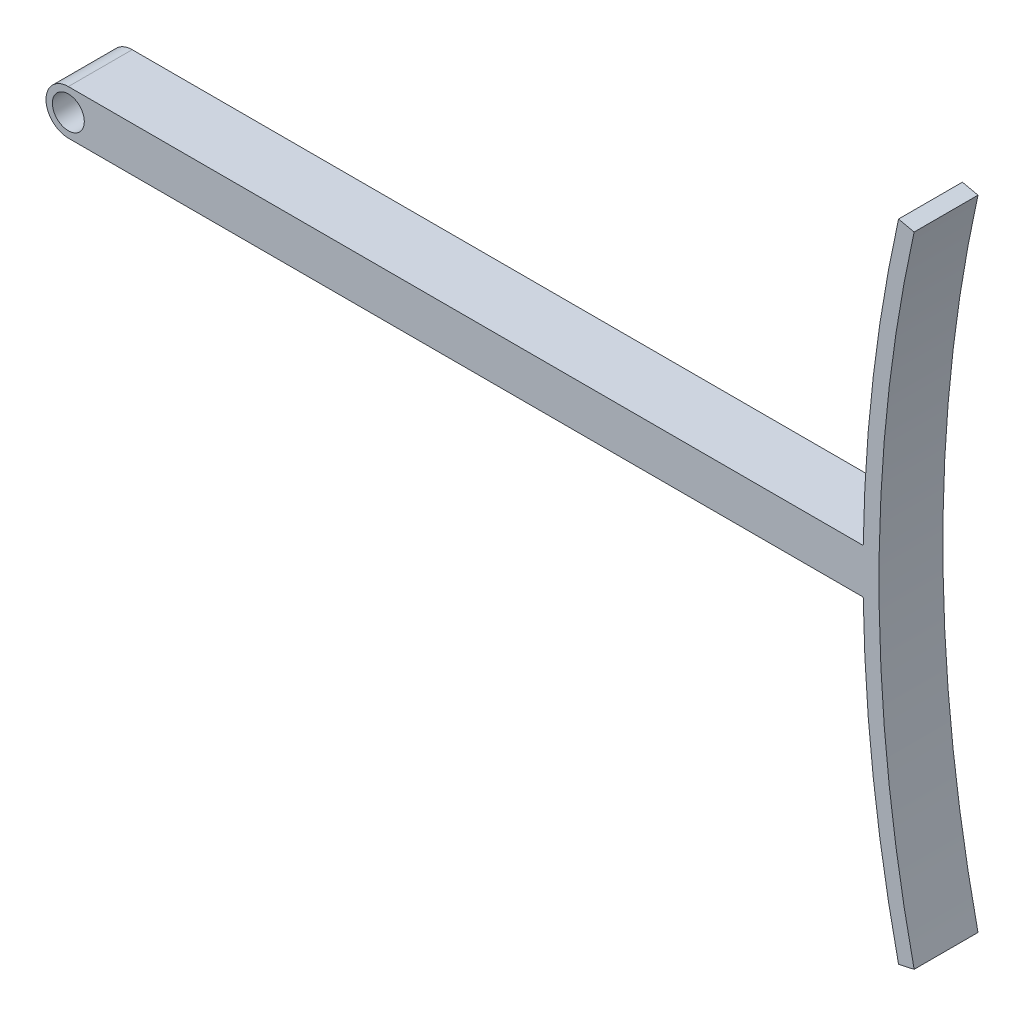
ISO-10303-21;
HEADER;
FILE_DESCRIPTION(('STEP AP214'),'2;1');
FILE_NAME('part.step','',(''),(''),'','','');
FILE_SCHEMA(('AUTOMOTIVE_DESIGN { 1 0 10303 214 1 1 1 1 }'));
ENDSEC;
DATA;
#1=APPLICATION_CONTEXT('core data for automotive mechanical design processes');
#2=APPLICATION_PROTOCOL_DEFINITION('international standard','automotive_design',2000,#1);
#3=PRODUCT_CONTEXT('',#1,'mechanical');
#4=PRODUCT('Part','Part','',(#3));
#5=PRODUCT_RELATED_PRODUCT_CATEGORY('part','',(#4));
#6=PRODUCT_DEFINITION_FORMATION('','',#4);
#7=PRODUCT_DEFINITION_CONTEXT('part definition',#1,'design');
#8=PRODUCT_DEFINITION('design','',#6,#7);
#9=PRODUCT_DEFINITION_SHAPE('','',#8);
#10=(LENGTH_UNIT() NAMED_UNIT(*) SI_UNIT(.MILLI.,.METRE.));
#11=(NAMED_UNIT(*) PLANE_ANGLE_UNIT() SI_UNIT($,.RADIAN.));
#12=(NAMED_UNIT(*) SI_UNIT($,.STERADIAN.) SOLID_ANGLE_UNIT());
#13=UNCERTAINTY_MEASURE_WITH_UNIT(LENGTH_MEASURE(1.E-05),#10,'distance_accuracy_value','');
#14=(GEOMETRIC_REPRESENTATION_CONTEXT(3) GLOBAL_UNCERTAINTY_ASSIGNED_CONTEXT((#13)) GLOBAL_UNIT_ASSIGNED_CONTEXT((#10,
#11,#12)) REPRESENTATION_CONTEXT('',''));
#15=CARTESIAN_POINT('',(0.,0.,0.));
#16=DIRECTION('',(0.,0.,1.));
#17=DIRECTION('',(1.,0.,0.));
#18=AXIS2_PLACEMENT_3D('',#15,#16,#17);
#19=CARTESIAN_POINT('',(713.91,0.,10.));
#20=DIRECTION('',(0.,0.,1.));
#21=DIRECTION('',(1.,0.,0.));
#22=AXIS2_PLACEMENT_3D('',#19,#20,#21);
#23=PLANE('',#22);
#24=CARTESIAN_POINT('',(713.91,0.,10.));
#25=DIRECTION('',(0.,0.,1.));
#26=DIRECTION('',(1.,0.,0.));
#27=AXIS2_PLACEMENT_3D('',#24,#25,#26);
#28=CIRCLE('',#27,465.);
#29=CARTESIAN_POINT('',(260.030690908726,101.086956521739,10.));
#30=VERTEX_POINT('',#29);
#31=CARTESIAN_POINT('',(248.962691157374,7.,10.));
#32=VERTEX_POINT('',#31);
#33=EDGE_CURVE('E143',#30,#32,#28,.T.);
#34=ORIENTED_EDGE('',*,*,#33,.T.);
#35=DIRECTION('',(-1.,0.,0.));
#36=VECTOR('',#35,1.);
#37=CARTESIAN_POINT('',(0.,7.,10.));
#38=LINE('',#37,#36);
#39=CARTESIAN_POINT('',(0.,7.,10.));
#40=VERTEX_POINT('',#39);
#41=EDGE_CURVE('E91',#32,#40,#38,.T.);
#42=ORIENTED_EDGE('',*,*,#41,.T.);
#43=CARTESIAN_POINT('',(0.,0.,10.));
#44=DIRECTION('',(0.,0.,1.));
#45=DIRECTION('',(1.,0.,0.));
#46=AXIS2_PLACEMENT_3D('',#43,#44,#45);
#47=CIRCLE('',#46,7.);
#48=CARTESIAN_POINT('',(0.,-7.,10.));
#49=VERTEX_POINT('',#48);
#50=EDGE_CURVE('E158',#40,#49,#47,.T.);
#51=ORIENTED_EDGE('',*,*,#50,.T.);
#52=DIRECTION('',(1.,0.,0.));
#53=VECTOR('',#52,1.);
#54=CARTESIAN_POINT('',(0.,-7.,10.));
#55=LINE('',#54,#53);
#56=CARTESIAN_POINT('',(248.962691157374,-7.,10.));
#57=VERTEX_POINT('',#56);
#58=EDGE_CURVE('E171',#49,#57,#55,.T.);
#59=ORIENTED_EDGE('',*,*,#58,.T.);
#60=CARTESIAN_POINT('',(713.91,0.,10.));
#61=DIRECTION('',(0.,0.,1.));
#62=DIRECTION('',(1.,0.,0.));
#63=AXIS2_PLACEMENT_3D('',#60,#61,#62);
#64=CIRCLE('',#63,465.);
#65=CARTESIAN_POINT('',(260.030690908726,-101.086956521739,10.));
#66=VERTEX_POINT('',#65);
#67=EDGE_CURVE('E110',#57,#66,#64,.T.);
#68=ORIENTED_EDGE('',*,*,#67,.T.);
#69=DIRECTION('',(0.976084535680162,0.21739130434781,0.));
#70=VECTOR('',#69,1.);
#71=CARTESIAN_POINT('',(260.030690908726,-101.086956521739,10.));
#72=LINE('',#71,#70);
#73=CARTESIAN_POINT('',(264.911113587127,-100.,10.));
#74=VERTEX_POINT('',#73);
#75=EDGE_CURVE('E104',#66,#74,#72,.T.);
#76=ORIENTED_EDGE('',*,*,#75,.T.);
#77=CARTESIAN_POINT('',(713.91,0.,10.));
#78=DIRECTION('',(0.,0.,-1.));
#79=DIRECTION('',(1.,0.,0.));
#80=AXIS2_PLACEMENT_3D('',#77,#78,#79);
#81=CIRCLE('',#80,460.);
#82=CARTESIAN_POINT('',(264.911113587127,100.,10.));
#83=VERTEX_POINT('',#82);
#84=EDGE_CURVE('E108',#74,#83,#81,.T.);
#85=ORIENTED_EDGE('',*,*,#84,.T.);
#86=DIRECTION('',(-0.976084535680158,0.217391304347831,0.));
#87=VECTOR('',#86,1.);
#88=CARTESIAN_POINT('',(260.030690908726,101.086956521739,10.));
#89=LINE('',#88,#87);
#90=EDGE_CURVE('E48',#83,#30,#89,.T.);
#91=ORIENTED_EDGE('',*,*,#90,.T.);
#92=EDGE_LOOP('',(#34,#42,#51,#59,#68,#76,#85,#91));
#93=FACE_BOUND('',#92,.T.);
#94=CARTESIAN_POINT('',(0.,0.,10.));
#95=DIRECTION('',(0.,0.,1.));
#96=DIRECTION('',(1.,0.,0.));
#97=AXIS2_PLACEMENT_3D('',#94,#95,#96);
#98=CIRCLE('',#97,5.);
#99=CARTESIAN_POINT('',(5.,0.,10.));
#100=VERTEX_POINT('',#99);
#101=EDGE_CURVE('E132',#100,#100,#98,.T.);
#102=ORIENTED_EDGE('',*,*,#101,.F.);
#103=EDGE_LOOP('',(#102));
#104=FACE_BOUND('',#103,.T.);
#105=ADVANCED_FACE('F31',(#93,#104),#23,.T.);
#106=CARTESIAN_POINT('',(713.91,0.,-10.));
#107=DIRECTION('',(0.,0.,1.));
#108=DIRECTION('',(1.,0.,0.));
#109=AXIS2_PLACEMENT_3D('',#106,#107,#108);
#110=PLANE('',#109);
#111=CARTESIAN_POINT('',(713.91,0.,-10.));
#112=DIRECTION('',(0.,0.,1.));
#113=DIRECTION('',(1.,0.,0.));
#114=AXIS2_PLACEMENT_3D('',#111,#112,#113);
#115=CIRCLE('',#114,465.);
#116=CARTESIAN_POINT('',(260.030690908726,101.086956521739,-10.));
#117=VERTEX_POINT('',#116);
#118=CARTESIAN_POINT('',(248.962691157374,7.,-10.));
#119=VERTEX_POINT('',#118);
#120=EDGE_CURVE('E128',#117,#119,#115,.T.);
#121=ORIENTED_EDGE('',*,*,#120,.F.);
#122=DIRECTION('',(-0.976084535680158,0.217391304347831,0.));
#123=VECTOR('',#122,1.);
#124=CARTESIAN_POINT('',(260.030690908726,101.086956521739,-10.));
#125=LINE('',#124,#123);
#126=CARTESIAN_POINT('',(264.911113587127,100.,-10.));
#127=VERTEX_POINT('',#126);
#128=EDGE_CURVE('E83',#127,#117,#125,.T.);
#129=ORIENTED_EDGE('',*,*,#128,.F.);
#130=CARTESIAN_POINT('',(713.91,0.,-10.));
#131=DIRECTION('',(0.,0.,-1.));
#132=DIRECTION('',(1.,0.,0.));
#133=AXIS2_PLACEMENT_3D('',#130,#131,#132);
#134=CIRCLE('',#133,460.);
#135=CARTESIAN_POINT('',(264.911113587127,-100.,-10.));
#136=VERTEX_POINT('',#135);
#137=EDGE_CURVE('E77',#136,#127,#134,.T.);
#138=ORIENTED_EDGE('',*,*,#137,.F.);
#139=DIRECTION('',(0.976084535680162,0.21739130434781,0.));
#140=VECTOR('',#139,1.);
#141=CARTESIAN_POINT('',(260.030690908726,-101.086956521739,-10.));
#142=LINE('',#141,#140);
#143=CARTESIAN_POINT('',(260.030690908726,-101.086956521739,-10.));
#144=VERTEX_POINT('',#143);
#145=EDGE_CURVE('E118',#144,#136,#142,.T.);
#146=ORIENTED_EDGE('',*,*,#145,.F.);
#147=CARTESIAN_POINT('',(713.91,0.,-10.));
#148=DIRECTION('',(0.,0.,1.));
#149=DIRECTION('',(1.,0.,0.));
#150=AXIS2_PLACEMENT_3D('',#147,#148,#149);
#151=CIRCLE('',#150,465.);
#152=CARTESIAN_POINT('',(248.962691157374,-7.,-10.));
#153=VERTEX_POINT('',#152);
#154=EDGE_CURVE('E138',#153,#144,#151,.T.);
#155=ORIENTED_EDGE('',*,*,#154,.F.);
#156=DIRECTION('',(1.,0.,0.));
#157=VECTOR('',#156,1.);
#158=CARTESIAN_POINT('',(0.,-7.,-10.));
#159=LINE('',#158,#157);
#160=CARTESIAN_POINT('',(0.,-7.,-10.));
#161=VERTEX_POINT('',#160);
#162=EDGE_CURVE('E136',#161,#153,#159,.T.);
#163=ORIENTED_EDGE('',*,*,#162,.F.);
#164=CARTESIAN_POINT('',(0.,0.,-10.));
#165=DIRECTION('',(0.,0.,1.));
#166=DIRECTION('',(1.,0.,0.));
#167=AXIS2_PLACEMENT_3D('',#164,#165,#166);
#168=CIRCLE('',#167,7.);
#169=CARTESIAN_POINT('',(0.,7.,-10.));
#170=VERTEX_POINT('',#169);
#171=EDGE_CURVE('E134',#170,#161,#168,.T.);
#172=ORIENTED_EDGE('',*,*,#171,.F.);
#173=DIRECTION('',(-1.,0.,0.));
#174=VECTOR('',#173,1.);
#175=CARTESIAN_POINT('',(0.,7.,-10.));
#176=LINE('',#175,#174);
#177=EDGE_CURVE('E131',#119,#170,#176,.T.);
#178=ORIENTED_EDGE('',*,*,#177,.F.);
#179=EDGE_LOOP('',(#121,#129,#138,#146,#155,#163,#172,#178));
#180=FACE_BOUND('',#179,.T.);
#181=CARTESIAN_POINT('',(0.,0.,-10.));
#182=DIRECTION('',(0.,0.,1.));
#183=DIRECTION('',(1.,0.,0.));
#184=AXIS2_PLACEMENT_3D('',#181,#182,#183);
#185=CIRCLE('',#184,5.);
#186=CARTESIAN_POINT('',(5.,0.,-10.));
#187=VERTEX_POINT('',#186);
#188=EDGE_CURVE('E177',#187,#187,#185,.T.);
#189=ORIENTED_EDGE('',*,*,#188,.T.);
#190=EDGE_LOOP('',(#189));
#191=FACE_BOUND('',#190,.T.);
#192=ADVANCED_FACE('F162',(#180,#191),#110,.F.);
#193=CARTESIAN_POINT('',(713.91,0.,10.));
#194=DIRECTION('',(0.,0.,-1.));
#195=DIRECTION('',(-1.,0.,0.));
#196=AXIS2_PLACEMENT_3D('',#193,#194,#195);
#197=CYLINDRICAL_SURFACE('',#196,465.);
#198=ORIENTED_EDGE('',*,*,#120,.T.);
#199=DIRECTION('',(0.,0.,-1.));
#200=VECTOR('',#199,1.);
#201=CARTESIAN_POINT('',(248.962691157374,7.,10.));
#202=LINE('',#201,#200);
#203=EDGE_CURVE('E11',#32,#119,#202,.T.);
#204=ORIENTED_EDGE('',*,*,#203,.F.);
#205=ORIENTED_EDGE('',*,*,#33,.F.);
#206=DIRECTION('',(0.,0.,-1.));
#207=VECTOR('',#206,1.);
#208=CARTESIAN_POINT('',(260.030690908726,101.086956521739,10.));
#209=LINE('',#208,#207);
#210=EDGE_CURVE('E124',#30,#117,#209,.T.);
#211=ORIENTED_EDGE('',*,*,#210,.T.);
#212=EDGE_LOOP('',(#198,#204,#205,#211));
#213=FACE_BOUND('',#212,.T.);
#214=ADVANCED_FACE('F33',(#213),#197,.T.);
#215=CARTESIAN_POINT('',(0.,7.,10.));
#216=DIRECTION('',(0.,-1.,0.));
#217=DIRECTION('',(0.,0.,-1.));
#218=AXIS2_PLACEMENT_3D('',#215,#216,#217);
#219=PLANE('',#218);
#220=ORIENTED_EDGE('',*,*,#177,.T.);
#221=DIRECTION('',(0.,0.,-1.));
#222=VECTOR('',#221,1.);
#223=CARTESIAN_POINT('',(0.,7.,10.));
#224=LINE('',#223,#222);
#225=EDGE_CURVE('E40',#40,#170,#224,.T.);
#226=ORIENTED_EDGE('',*,*,#225,.F.);
#227=ORIENTED_EDGE('',*,*,#41,.F.);
#228=ORIENTED_EDGE('',*,*,#203,.T.);
#229=EDGE_LOOP('',(#220,#226,#227,#228));
#230=FACE_BOUND('',#229,.T.);
#231=ADVANCED_FACE('F205',(#230),#219,.F.);
#232=CARTESIAN_POINT('',(0.,0.,10.));
#233=DIRECTION('',(0.,0.,-1.));
#234=DIRECTION('',(-1.,0.,0.));
#235=AXIS2_PLACEMENT_3D('',#232,#233,#234);
#236=CYLINDRICAL_SURFACE('',#235,7.);
#237=ORIENTED_EDGE('',*,*,#171,.T.);
#238=DIRECTION('',(0.,0.,-1.));
#239=VECTOR('',#238,1.);
#240=CARTESIAN_POINT('',(0.,-7.,10.));
#241=LINE('',#240,#239);
#242=EDGE_CURVE('E150',#49,#161,#241,.T.);
#243=ORIENTED_EDGE('',*,*,#242,.F.);
#244=ORIENTED_EDGE('',*,*,#50,.F.);
#245=ORIENTED_EDGE('',*,*,#225,.T.);
#246=EDGE_LOOP('',(#237,#243,#244,#245));
#247=FACE_BOUND('',#246,.T.);
#248=ADVANCED_FACE('F156',(#247),#236,.T.);
#249=CARTESIAN_POINT('',(0.,-7.,10.));
#250=DIRECTION('',(0.,1.,0.));
#251=DIRECTION('',(0.,0.,1.));
#252=AXIS2_PLACEMENT_3D('',#249,#250,#251);
#253=PLANE('',#252);
#254=ORIENTED_EDGE('',*,*,#162,.T.);
#255=DIRECTION('',(0.,0.,-1.));
#256=VECTOR('',#255,1.);
#257=CARTESIAN_POINT('',(248.962691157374,-7.,10.));
#258=LINE('',#257,#256);
#259=EDGE_CURVE('E147',#57,#153,#258,.T.);
#260=ORIENTED_EDGE('',*,*,#259,.F.);
#261=ORIENTED_EDGE('',*,*,#58,.F.);
#262=ORIENTED_EDGE('',*,*,#242,.T.);
#263=EDGE_LOOP('',(#254,#260,#261,#262));
#264=FACE_BOUND('',#263,.T.);
#265=ADVANCED_FACE('F167',(#264),#253,.F.);
#266=CARTESIAN_POINT('',(713.91,0.,10.));
#267=DIRECTION('',(0.,0.,-1.));
#268=DIRECTION('',(-1.,0.,0.));
#269=AXIS2_PLACEMENT_3D('',#266,#267,#268);
#270=CYLINDRICAL_SURFACE('',#269,465.);
#271=ORIENTED_EDGE('',*,*,#154,.T.);
#272=DIRECTION('',(0.,0.,-1.));
#273=VECTOR('',#272,1.);
#274=CARTESIAN_POINT('',(260.030690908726,-101.086956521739,10.));
#275=LINE('',#274,#273);
#276=EDGE_CURVE('E119',#66,#144,#275,.T.);
#277=ORIENTED_EDGE('',*,*,#276,.F.);
#278=ORIENTED_EDGE('',*,*,#67,.F.);
#279=ORIENTED_EDGE('',*,*,#259,.T.);
#280=EDGE_LOOP('',(#271,#277,#278,#279));
#281=FACE_BOUND('',#280,.T.);
#282=ADVANCED_FACE('F170',(#281),#270,.T.);
#283=CARTESIAN_POINT('',(260.030690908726,-101.086956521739,10.));
#284=DIRECTION('',(-0.21739130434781,0.976084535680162,0.));
#285=DIRECTION('',(-0.976084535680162,-0.21739130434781,0.));
#286=AXIS2_PLACEMENT_3D('',#283,#284,#285);
#287=PLANE('',#286);
#288=ORIENTED_EDGE('',*,*,#145,.T.);
#289=DIRECTION('',(0.,0.,-1.));
#290=VECTOR('',#289,1.);
#291=CARTESIAN_POINT('',(264.911113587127,-100.,10.));
#292=LINE('',#291,#290);
#293=EDGE_CURVE('E115',#74,#136,#292,.T.);
#294=ORIENTED_EDGE('',*,*,#293,.F.);
#295=ORIENTED_EDGE('',*,*,#75,.F.);
#296=ORIENTED_EDGE('',*,*,#276,.T.);
#297=EDGE_LOOP('',(#288,#294,#295,#296));
#298=FACE_BOUND('',#297,.T.);
#299=ADVANCED_FACE('F116',(#298),#287,.F.);
#300=CARTESIAN_POINT('',(713.91,0.,10.));
#301=DIRECTION('',(0.,0.,-1.));
#302=DIRECTION('',(-1.,0.,0.));
#303=AXIS2_PLACEMENT_3D('',#300,#301,#302);
#304=CYLINDRICAL_SURFACE('',#303,460.);
#305=ORIENTED_EDGE('',*,*,#137,.T.);
#306=DIRECTION('',(0.,0.,-1.));
#307=VECTOR('',#306,1.);
#308=CARTESIAN_POINT('',(264.911113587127,100.,10.));
#309=LINE('',#308,#307);
#310=EDGE_CURVE('E120',#83,#127,#309,.T.);
#311=ORIENTED_EDGE('',*,*,#310,.F.);
#312=ORIENTED_EDGE('',*,*,#84,.F.);
#313=ORIENTED_EDGE('',*,*,#293,.T.);
#314=EDGE_LOOP('',(#305,#311,#312,#313));
#315=FACE_BOUND('',#314,.T.);
#316=ADVANCED_FACE('F122',(#315),#304,.F.);
#317=CARTESIAN_POINT('',(260.030690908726,101.086956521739,10.));
#318=DIRECTION('',(-0.217391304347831,-0.976084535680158,0.));
#319=DIRECTION('',(0.976084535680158,-0.217391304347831,0.));
#320=AXIS2_PLACEMENT_3D('',#317,#318,#319);
#321=PLANE('',#320);
#322=ORIENTED_EDGE('',*,*,#128,.T.);
#323=ORIENTED_EDGE('',*,*,#210,.F.);
#324=ORIENTED_EDGE('',*,*,#90,.F.);
#325=ORIENTED_EDGE('',*,*,#310,.T.);
#326=EDGE_LOOP('',(#322,#323,#324,#325));
#327=FACE_BOUND('',#326,.T.);
#328=ADVANCED_FACE('F193',(#327),#321,.F.);
#329=CARTESIAN_POINT('',(0.,0.,10.));
#330=DIRECTION('',(0.,0.,-1.));
#331=DIRECTION('',(-1.,0.,0.));
#332=AXIS2_PLACEMENT_3D('',#329,#330,#331);
#333=CYLINDRICAL_SURFACE('',#332,5.);
#334=ORIENTED_EDGE('',*,*,#101,.T.);
#335=EDGE_LOOP('',(#334));
#336=FACE_BOUND('',#335,.T.);
#337=ORIENTED_EDGE('',*,*,#188,.F.);
#338=EDGE_LOOP('',(#337));
#339=FACE_BOUND('',#338,.T.);
#340=ADVANCED_FACE('F183',(#336,#339),#333,.F.);
#341=CLOSED_SHELL('',(#105,#192,#214,#231,#248,#265,#282,#299,#316,#328,#340));
#342=MANIFOLD_SOLID_BREP('B2',#341);
#343=ADVANCED_BREP_SHAPE_REPRESENTATION('',(#18,#342),#14);
#344=SHAPE_DEFINITION_REPRESENTATION(#9,#343);
ENDSEC;
END-ISO-10303-21;
